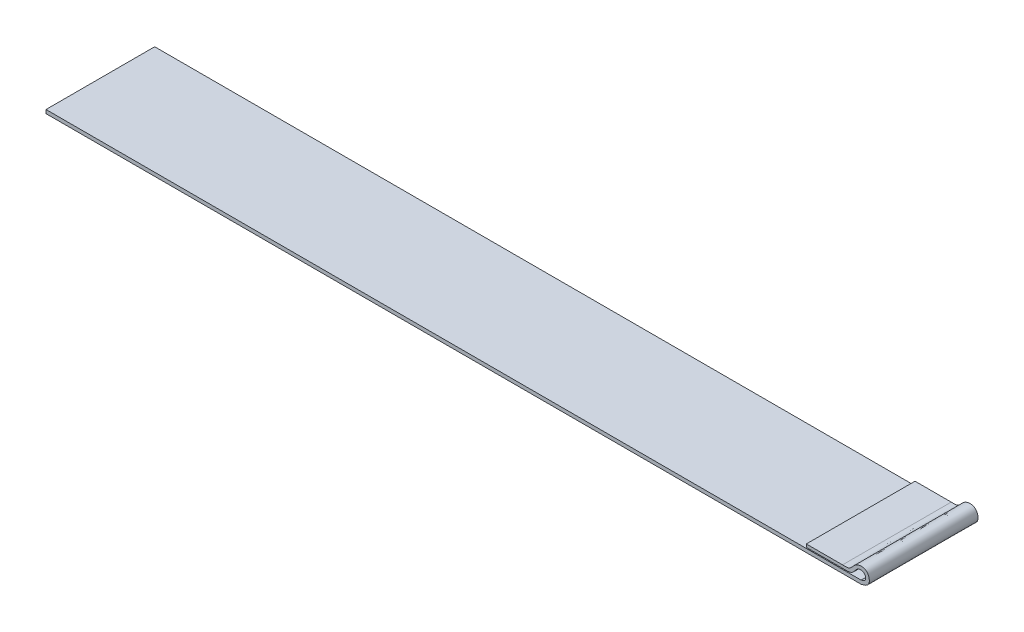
ISO-10303-21;
HEADER;
FILE_DESCRIPTION(('STEP AP214'),'2;1');
FILE_NAME('part.step','',(''),(''),'','','');
FILE_SCHEMA(('AUTOMOTIVE_DESIGN { 1 0 10303 214 1 1 1 1 }'));
ENDSEC;
DATA;
#1=APPLICATION_CONTEXT('core data for automotive mechanical design processes');
#2=APPLICATION_PROTOCOL_DEFINITION('international standard','automotive_design',2000,#1);
#3=PRODUCT_CONTEXT('',#1,'mechanical');
#4=PRODUCT('Part','Part','',(#3));
#5=PRODUCT_RELATED_PRODUCT_CATEGORY('part','',(#4));
#6=PRODUCT_DEFINITION_FORMATION('','',#4);
#7=PRODUCT_DEFINITION_CONTEXT('part definition',#1,'design');
#8=PRODUCT_DEFINITION('design','',#6,#7);
#9=PRODUCT_DEFINITION_SHAPE('','',#8);
#10=(LENGTH_UNIT() NAMED_UNIT(*) SI_UNIT(.MILLI.,.METRE.));
#11=(NAMED_UNIT(*) PLANE_ANGLE_UNIT() SI_UNIT($,.RADIAN.));
#12=(NAMED_UNIT(*) SI_UNIT($,.STERADIAN.) SOLID_ANGLE_UNIT());
#13=UNCERTAINTY_MEASURE_WITH_UNIT(LENGTH_MEASURE(1.E-05),#10,'distance_accuracy_value','');
#14=(GEOMETRIC_REPRESENTATION_CONTEXT(3) GLOBAL_UNCERTAINTY_ASSIGNED_CONTEXT((#13)) GLOBAL_UNIT_ASSIGNED_CONTEXT((#10,
#11,#12)) REPRESENTATION_CONTEXT('',''));
#15=CARTESIAN_POINT('',(0.,0.,0.));
#16=DIRECTION('',(0.,0.,1.));
#17=DIRECTION('',(1.,0.,0.));
#18=AXIS2_PLACEMENT_3D('',#15,#16,#17);
#19=CARTESIAN_POINT('',(-13.0220458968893,0.66221847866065,76.2));
#20=CARTESIAN_POINT('',(-10.288474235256,0.550712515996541,76.2));
#21=CARTESIAN_POINT('',(-5.74665038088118,0.365445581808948,76.2));
#22=CARTESIAN_POINT('',(-3.24386960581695,6.06140478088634,76.2));
#23=CARTESIAN_POINT('',(2.4405241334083,6.59126096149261,76.2));
#24=CARTESIAN_POINT('',(3.97528287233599,1.24196399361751,76.2));
#25=CARTESIAN_POINT('',(1.2979747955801,0.40551528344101,76.2));
#26=CARTESIAN_POINT('',(0.,0.,76.2));
#27=B_SPLINE_CURVE_WITH_KNOTS('',3,(#19,#20,#21,#22,#23,#24,#25,#26),.UNSPECIFIED.,.F.,.F.,(4,1,
1,1,1,4),(0.,0.305747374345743,0.507998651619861,0.695738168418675,0.852492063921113,1.),.UNSPECIFIED.);
#28=DIRECTION('',(0.,0.,-1.));
#29=VECTOR('',#28,1.);
#30=SURFACE_OF_LINEAR_EXTRUSION('',#27,#29);
#31=CARTESIAN_POINT('',(-13.0220458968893,0.66221847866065,0.));
#32=CARTESIAN_POINT('',(-10.288474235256,0.550712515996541,0.));
#33=CARTESIAN_POINT('',(-5.74665038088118,0.365445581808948,0.));
#34=CARTESIAN_POINT('',(-3.24386960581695,6.06140478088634,0.));
#35=CARTESIAN_POINT('',(2.4405241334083,6.59126096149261,0.));
#36=CARTESIAN_POINT('',(3.97528287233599,1.24196399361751,0.));
#37=CARTESIAN_POINT('',(1.2979747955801,0.40551528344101,0.));
#38=CARTESIAN_POINT('',(0.,0.,0.));
#39=B_SPLINE_CURVE_WITH_KNOTS('',3,(#31,#32,#33,#34,#35,#36,#37,#38),.UNSPECIFIED.,.F.,.F.,(4,1,
1,1,1,4),(0.,0.305747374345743,0.507998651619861,0.695738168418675,0.852492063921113,1.),.UNSPECIFIED.);
#40=CARTESIAN_POINT('',(-13.0220458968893,0.66221847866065,0.));
#41=VERTEX_POINT('',#40);
#42=CARTESIAN_POINT('',(0.,0.,0.));
#43=VERTEX_POINT('',#42);
#44=EDGE_CURVE('E127',#41,#43,#39,.T.);
#45=ORIENTED_EDGE('',*,*,#44,.T.);
#46=DIRECTION('',(0.,0.,-1.));
#47=VECTOR('',#46,1.);
#48=CARTESIAN_POINT('',(0.,0.,76.2));
#49=LINE('',#48,#47);
#50=CARTESIAN_POINT('',(0.,0.,76.2));
#51=VERTEX_POINT('',#50);
#52=EDGE_CURVE('E11',#51,#43,#49,.T.);
#53=ORIENTED_EDGE('',*,*,#52,.F.);
#54=CARTESIAN_POINT('',(-13.0220458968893,0.66221847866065,76.2));
#55=VERTEX_POINT('',#54);
#56=EDGE_CURVE('E151',#55,#51,#27,.T.);
#57=ORIENTED_EDGE('',*,*,#56,.F.);
#58=DIRECTION('',(0.,0.,-1.));
#59=VECTOR('',#58,1.);
#60=CARTESIAN_POINT('',(-13.0220458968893,0.66221847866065,76.2));
#61=LINE('',#60,#59);
#62=EDGE_CURVE('E123',#55,#41,#61,.T.);
#63=ORIENTED_EDGE('',*,*,#62,.T.);
#64=EDGE_LOOP('',(#45,#53,#57,#63));
#65=FACE_BOUND('',#64,.T.);
#66=ADVANCED_FACE('F30',(#65),#30,.F.);
#67=CARTESIAN_POINT('',(0.,0.,76.2));
#68=DIRECTION('',(0.,-1.,0.));
#69=DIRECTION('',(1.,0.,0.));
#70=AXIS2_PLACEMENT_3D('',#67,#68,#69);
#71=PLANE('',#70);
#72=DIRECTION('',(-1.,0.,0.));
#73=VECTOR('',#72,1.);
#74=CARTESIAN_POINT('',(0.,0.,0.));
#75=LINE('',#74,#73);
#76=CARTESIAN_POINT('',(-571.499999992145,0.,0.));
#77=VERTEX_POINT('',#76);
#78=EDGE_CURVE('E132',#43,#77,#75,.T.);
#79=ORIENTED_EDGE('',*,*,#78,.T.);
#80=DIRECTION('',(0.,0.,-1.));
#81=VECTOR('',#80,1.);
#82=CARTESIAN_POINT('',(-571.499999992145,0.,76.2));
#83=LINE('',#82,#81);
#84=CARTESIAN_POINT('',(-571.499999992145,0.,76.2));
#85=VERTEX_POINT('',#84);
#86=EDGE_CURVE('E39',#85,#77,#83,.T.);
#87=ORIENTED_EDGE('',*,*,#86,.F.);
#88=DIRECTION('',(-1.,0.,0.));
#89=VECTOR('',#88,1.);
#90=CARTESIAN_POINT('',(0.,0.,76.2));
#91=LINE('',#90,#89);
#92=EDGE_CURVE('E90',#51,#85,#91,.T.);
#93=ORIENTED_EDGE('',*,*,#92,.F.);
#94=ORIENTED_EDGE('',*,*,#52,.T.);
#95=EDGE_LOOP('',(#79,#87,#93,#94));
#96=FACE_BOUND('',#95,.T.);
#97=ADVANCED_FACE('F195',(#96),#71,.F.);
#98=CARTESIAN_POINT('',(-571.499999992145,0.,76.2));
#99=DIRECTION('',(1.,0.,0.));
#100=DIRECTION('',(0.,0.,-1.));
#101=AXIS2_PLACEMENT_3D('',#98,#99,#100);
#102=PLANE('',#101);
#103=DIRECTION('',(0.,-1.,0.));
#104=VECTOR('',#103,1.);
#105=CARTESIAN_POINT('',(-571.499999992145,0.,0.));
#106=LINE('',#105,#104);
#107=CARTESIAN_POINT('',(-571.499999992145,-2.54000000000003,0.));
#108=VERTEX_POINT('',#107);
#109=EDGE_CURVE('E137',#77,#108,#106,.T.);
#110=ORIENTED_EDGE('',*,*,#109,.T.);
#111=DIRECTION('',(0.,0.,-1.));
#112=VECTOR('',#111,1.);
#113=CARTESIAN_POINT('',(-571.499999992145,-2.54000000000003,76.2));
#114=LINE('',#113,#112);
#115=CARTESIAN_POINT('',(-571.499999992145,-2.54000000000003,76.2));
#116=VERTEX_POINT('',#115);
#117=EDGE_CURVE('E158',#116,#108,#114,.T.);
#118=ORIENTED_EDGE('',*,*,#117,.F.);
#119=DIRECTION('',(0.,-1.,0.));
#120=VECTOR('',#119,1.);
#121=CARTESIAN_POINT('',(-571.499999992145,0.,76.2));
#122=LINE('',#121,#120);
#123=EDGE_CURVE('E166',#85,#116,#122,.T.);
#124=ORIENTED_EDGE('',*,*,#123,.F.);
#125=ORIENTED_EDGE('',*,*,#86,.T.);
#126=EDGE_LOOP('',(#110,#118,#124,#125));
#127=FACE_BOUND('',#126,.T.);
#128=ADVANCED_FACE('F164',(#127),#102,.F.);
#129=CARTESIAN_POINT('',(-571.499999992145,-2.54000000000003,76.2));
#130=DIRECTION('',(0.,1.,0.));
#131=DIRECTION('',(0.,0.,1.));
#132=AXIS2_PLACEMENT_3D('',#129,#130,#131);
#133=PLANE('',#132);
#134=DIRECTION('',(1.,0.,0.));
#135=VECTOR('',#134,1.);
#136=CARTESIAN_POINT('',(-571.499999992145,-2.54000000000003,0.));
#137=LINE('',#136,#135);
#138=CARTESIAN_POINT('',(0.179199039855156,-2.54000000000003,0.));
#139=VERTEX_POINT('',#138);
#140=EDGE_CURVE('E139',#108,#139,#137,.T.);
#141=ORIENTED_EDGE('',*,*,#140,.T.);
#142=DIRECTION('',(0.,0.,-1.));
#143=VECTOR('',#142,1.);
#144=CARTESIAN_POINT('',(0.179199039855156,-2.54000000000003,76.2));
#145=LINE('',#144,#143);
#146=CARTESIAN_POINT('',(0.179199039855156,-2.54000000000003,76.2));
#147=VERTEX_POINT('',#146);
#148=EDGE_CURVE('E155',#147,#139,#145,.T.);
#149=ORIENTED_EDGE('',*,*,#148,.F.);
#150=DIRECTION('',(1.,0.,0.));
#151=VECTOR('',#150,1.);
#152=CARTESIAN_POINT('',(-571.499999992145,-2.54000000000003,76.2));
#153=LINE('',#152,#151);
#154=EDGE_CURVE('E178',#116,#147,#153,.T.);
#155=ORIENTED_EDGE('',*,*,#154,.F.);
#156=ORIENTED_EDGE('',*,*,#117,.T.);
#157=EDGE_LOOP('',(#141,#149,#155,#156));
#158=FACE_BOUND('',#157,.T.);
#159=ADVANCED_FACE('F174',(#158),#133,.F.);
#160=CARTESIAN_POINT('',(0.179199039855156,-2.54000000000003,76.2));
#161=CARTESIAN_POINT('',(2.16284259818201,-2.00292513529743,76.2));
#162=CARTESIAN_POINT('',(6.81356083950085,-0.743735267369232,76.2));
#163=CARTESIAN_POINT('',(5.04619530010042,9.63183249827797,76.2));
#164=CARTESIAN_POINT('',(-4.31539330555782,8.37729318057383,76.2));
#165=CARTESIAN_POINT('',(-7.44988617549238,2.57250243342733,76.2));
#166=CARTESIAN_POINT('',(-11.1158936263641,2.6887543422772,76.2));
#167=CARTESIAN_POINT('',(-13.0220458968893,2.74919989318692,76.2));
#168=B_SPLINE_CURVE_WITH_KNOTS('',3,(#160,#161,#162,#163,#164,#165,#166,#167),.UNSPECIFIED.,.F.,
.F.,(4,1,1,1,1,4),(0.,0.177067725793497,0.415141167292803,0.676771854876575,0.831936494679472,
1.),.UNSPECIFIED.);
#169=DIRECTION('',(0.,0.,-1.));
#170=VECTOR('',#169,1.);
#171=SURFACE_OF_LINEAR_EXTRUSION('',#168,#170);
#172=CARTESIAN_POINT('',(0.179199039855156,-2.54000000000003,0.));
#173=CARTESIAN_POINT('',(2.16284259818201,-2.00292513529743,0.));
#174=CARTESIAN_POINT('',(6.81356083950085,-0.743735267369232,0.));
#175=CARTESIAN_POINT('',(5.04619530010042,9.63183249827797,0.));
#176=CARTESIAN_POINT('',(-4.31539330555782,8.37729318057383,0.));
#177=CARTESIAN_POINT('',(-7.44988617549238,2.57250243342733,0.));
#178=CARTESIAN_POINT('',(-11.1158936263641,2.6887543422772,0.));
#179=CARTESIAN_POINT('',(-13.0220458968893,2.74919989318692,0.));
#180=B_SPLINE_CURVE_WITH_KNOTS('',3,(#172,#173,#174,#175,#176,#177,#178,#179),.UNSPECIFIED.,.F.,
.F.,(4,1,1,1,1,4),(0.,0.177067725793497,0.415141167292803,0.676771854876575,0.831936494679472,
1.),.UNSPECIFIED.);
#181=CARTESIAN_POINT('',(-13.0220458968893,2.74919989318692,0.));
#182=VERTEX_POINT('',#181);
#183=EDGE_CURVE('E141',#139,#182,#180,.T.);
#184=ORIENTED_EDGE('',*,*,#183,.T.);
#185=DIRECTION('',(0.,0.,-1.));
#186=VECTOR('',#185,1.);
#187=CARTESIAN_POINT('',(-13.0220458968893,2.74919989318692,76.2));
#188=LINE('',#187,#186);
#189=CARTESIAN_POINT('',(-13.0220458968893,2.74919989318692,76.2));
#190=VERTEX_POINT('',#189);
#191=EDGE_CURVE('E118',#190,#182,#188,.T.);
#192=ORIENTED_EDGE('',*,*,#191,.F.);
#193=EDGE_CURVE('E109',#147,#190,#168,.T.);
#194=ORIENTED_EDGE('',*,*,#193,.F.);
#195=ORIENTED_EDGE('',*,*,#148,.T.);
#196=EDGE_LOOP('',(#184,#192,#194,#195));
#197=FACE_BOUND('',#196,.T.);
#198=ADVANCED_FACE('F177',(#197),#171,.F.);
#199=CARTESIAN_POINT('',(-13.0220458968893,2.74919989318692,76.2));
#200=DIRECTION('',(0.,-1.,0.));
#201=DIRECTION('',(1.,0.,0.));
#202=AXIS2_PLACEMENT_3D('',#199,#200,#201);
#203=PLANE('',#202);
#204=DIRECTION('',(-1.,0.,0.));
#205=VECTOR('',#204,1.);
#206=CARTESIAN_POINT('',(-13.0220458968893,2.74919989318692,0.));
#207=LINE('',#206,#205);
#208=CARTESIAN_POINT('',(-38.4220458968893,2.74919989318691,0.));
#209=VERTEX_POINT('',#208);
#210=EDGE_CURVE('E117',#182,#209,#207,.T.);
#211=ORIENTED_EDGE('',*,*,#210,.T.);
#212=DIRECTION('',(0.,0.,-1.));
#213=VECTOR('',#212,1.);
#214=CARTESIAN_POINT('',(-38.4220458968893,2.74919989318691,76.2));
#215=LINE('',#214,#213);
#216=CARTESIAN_POINT('',(-38.4220458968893,2.74919989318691,76.2));
#217=VERTEX_POINT('',#216);
#218=EDGE_CURVE('E114',#217,#209,#215,.T.);
#219=ORIENTED_EDGE('',*,*,#218,.F.);
#220=DIRECTION('',(-1.,0.,0.));
#221=VECTOR('',#220,1.);
#222=CARTESIAN_POINT('',(-13.0220458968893,2.74919989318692,76.2));
#223=LINE('',#222,#221);
#224=EDGE_CURVE('E103',#190,#217,#223,.T.);
#225=ORIENTED_EDGE('',*,*,#224,.F.);
#226=ORIENTED_EDGE('',*,*,#191,.T.);
#227=EDGE_LOOP('',(#211,#219,#225,#226));
#228=FACE_BOUND('',#227,.T.);
#229=ADVANCED_FACE('F115',(#228),#203,.F.);
#230=CARTESIAN_POINT('',(-38.4220458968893,2.74919989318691,76.2));
#231=DIRECTION('',(1.,0.,0.));
#232=DIRECTION('',(0.,0.,-1.));
#233=AXIS2_PLACEMENT_3D('',#230,#231,#232);
#234=PLANE('',#233);
#235=DIRECTION('',(0.,-1.,0.));
#236=VECTOR('',#235,1.);
#237=CARTESIAN_POINT('',(-38.4220458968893,2.74919989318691,0.));
#238=LINE('',#237,#236);
#239=CARTESIAN_POINT('',(-38.4220458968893,0.662218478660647,0.));
#240=VERTEX_POINT('',#239);
#241=EDGE_CURVE('E76',#209,#240,#238,.T.);
#242=ORIENTED_EDGE('',*,*,#241,.T.);
#243=DIRECTION('',(0.,0.,-1.));
#244=VECTOR('',#243,1.);
#245=CARTESIAN_POINT('',(-38.4220458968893,0.662218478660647,76.2));
#246=LINE('',#245,#244);
#247=CARTESIAN_POINT('',(-38.4220458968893,0.662218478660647,76.2));
#248=VERTEX_POINT('',#247);
#249=EDGE_CURVE('E119',#248,#240,#246,.T.);
#250=ORIENTED_EDGE('',*,*,#249,.F.);
#251=DIRECTION('',(0.,-1.,0.));
#252=VECTOR('',#251,1.);
#253=CARTESIAN_POINT('',(-38.4220458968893,2.74919989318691,76.2));
#254=LINE('',#253,#252);
#255=EDGE_CURVE('E107',#217,#248,#254,.T.);
#256=ORIENTED_EDGE('',*,*,#255,.F.);
#257=ORIENTED_EDGE('',*,*,#218,.T.);
#258=EDGE_LOOP('',(#242,#250,#256,#257));
#259=FACE_BOUND('',#258,.T.);
#260=ADVANCED_FACE('F121',(#259),#234,.F.);
#261=CARTESIAN_POINT('',(-13.0220458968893,0.66221847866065,76.2));
#262=DIRECTION('',(0.,1.,0.));
#263=DIRECTION('',(-1.,0.,0.));
#264=AXIS2_PLACEMENT_3D('',#261,#262,#263);
#265=PLANE('',#264);
#266=DIRECTION('',(1.,0.,0.));
#267=VECTOR('',#266,1.);
#268=CARTESIAN_POINT('',(-13.0220458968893,0.66221847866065,0.));
#269=LINE('',#268,#267);
#270=EDGE_CURVE('E82',#240,#41,#269,.T.);
#271=ORIENTED_EDGE('',*,*,#270,.T.);
#272=ORIENTED_EDGE('',*,*,#62,.F.);
#273=DIRECTION('',(1.,0.,0.));
#274=VECTOR('',#273,1.);
#275=CARTESIAN_POINT('',(-13.0220458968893,0.66221847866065,76.2));
#276=LINE('',#275,#274);
#277=EDGE_CURVE('E47',#248,#55,#276,.T.);
#278=ORIENTED_EDGE('',*,*,#277,.F.);
#279=ORIENTED_EDGE('',*,*,#249,.T.);
#280=EDGE_LOOP('',(#271,#272,#278,#279));
#281=FACE_BOUND('',#280,.T.);
#282=ADVANCED_FACE('F203',(#281),#265,.F.);
#283=CARTESIAN_POINT('',(-2.64613796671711,5.31305041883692,76.2));
#284=DIRECTION('',(0.,0.,-1.));
#285=DIRECTION('',(-1.,0.,0.));
#286=AXIS2_PLACEMENT_3D('',#283,#284,#285);
#287=PLANE('',#286);
#288=ORIENTED_EDGE('',*,*,#56,.T.);
#289=ORIENTED_EDGE('',*,*,#92,.T.);
#290=ORIENTED_EDGE('',*,*,#123,.T.);
#291=ORIENTED_EDGE('',*,*,#154,.T.);
#292=ORIENTED_EDGE('',*,*,#193,.T.);
#293=ORIENTED_EDGE('',*,*,#224,.T.);
#294=ORIENTED_EDGE('',*,*,#255,.T.);
#295=ORIENTED_EDGE('',*,*,#277,.T.);
#296=EDGE_LOOP('',(#288,#289,#290,#291,#292,#293,#294,#295));
#297=FACE_BOUND('',#296,.T.);
#298=ADVANCED_FACE('F105',(#297),#287,.F.);
#299=CARTESIAN_POINT('',(-2.64613796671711,5.31305041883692,0.));
#300=DIRECTION('',(0.,0.,-1.));
#301=DIRECTION('',(-1.,0.,0.));
#302=AXIS2_PLACEMENT_3D('',#299,#300,#301);
#303=PLANE('',#302);
#304=ORIENTED_EDGE('',*,*,#44,.F.);
#305=ORIENTED_EDGE('',*,*,#270,.F.);
#306=ORIENTED_EDGE('',*,*,#241,.F.);
#307=ORIENTED_EDGE('',*,*,#210,.F.);
#308=ORIENTED_EDGE('',*,*,#183,.F.);
#309=ORIENTED_EDGE('',*,*,#140,.F.);
#310=ORIENTED_EDGE('',*,*,#109,.F.);
#311=ORIENTED_EDGE('',*,*,#78,.F.);
#312=EDGE_LOOP('',(#304,#305,#306,#307,#308,#309,#310,#311));
#313=FACE_BOUND('',#312,.T.);
#314=ADVANCED_FACE('F170',(#313),#303,.T.);
#315=CLOSED_SHELL('',(#66,#97,#128,#159,#198,#229,#260,#282,#298,#314));
#316=MANIFOLD_SOLID_BREP('B2',#315);
#317=ADVANCED_BREP_SHAPE_REPRESENTATION('',(#18,#316),#14);
#318=SHAPE_DEFINITION_REPRESENTATION(#9,#317);
ENDSEC;
END-ISO-10303-21;
